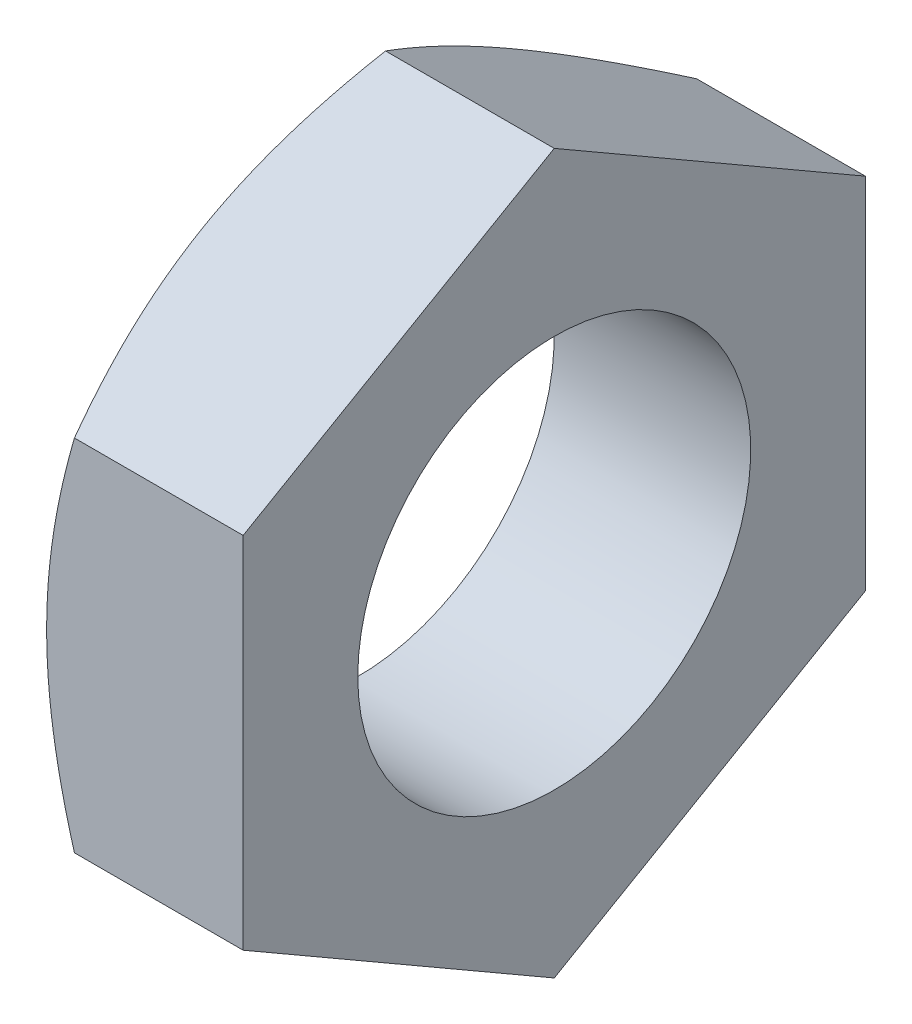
from build123d import *

# Parameters (mm, degrees)
HEXAGONE_DEPTH = 6
ESQ_TROU_R     = 6
TROU_DEPTH     = 16.702972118


with BuildPart() as part:
    # Esq_Hexagone → Hexagone (new body)
    with BuildSketch(Plane(origin=(0, 0, 0), x_dir=(0, 0, -1), z_dir=(1, 0, 0))):
        Polygon((9.5, -5.484827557), (9.5, 5.484827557), (0, 10.969655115), (-9.5, 5.484827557), (-9.5, -5.484827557), (0, -10.969655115), align=None)
    extrude(amount=HEXAGONE_DEPTH)

    # Esq_chanfrein → Chanfrein (revolve, cut)
    with BuildSketch(Plane(origin=(0, 0, 0), x_dir=(1, 0, 0), z_dir=(0, 1, 0))):
        Polygon((0, 9.5), (0, 19.892304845), (6, 19.892304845), align=None)
    revolve(axis=Axis((0, 0, 0), (1, 0, 0)), mode=Mode.SUBTRACT)

    # Esq_trou → Trou (cut, through all)
    with BuildSketch(Plane.ZY):
        Circle(ESQ_TROU_R)
    extrude(amount=-TROU_DEPTH, mode=Mode.SUBTRACT)


solid = part.part
